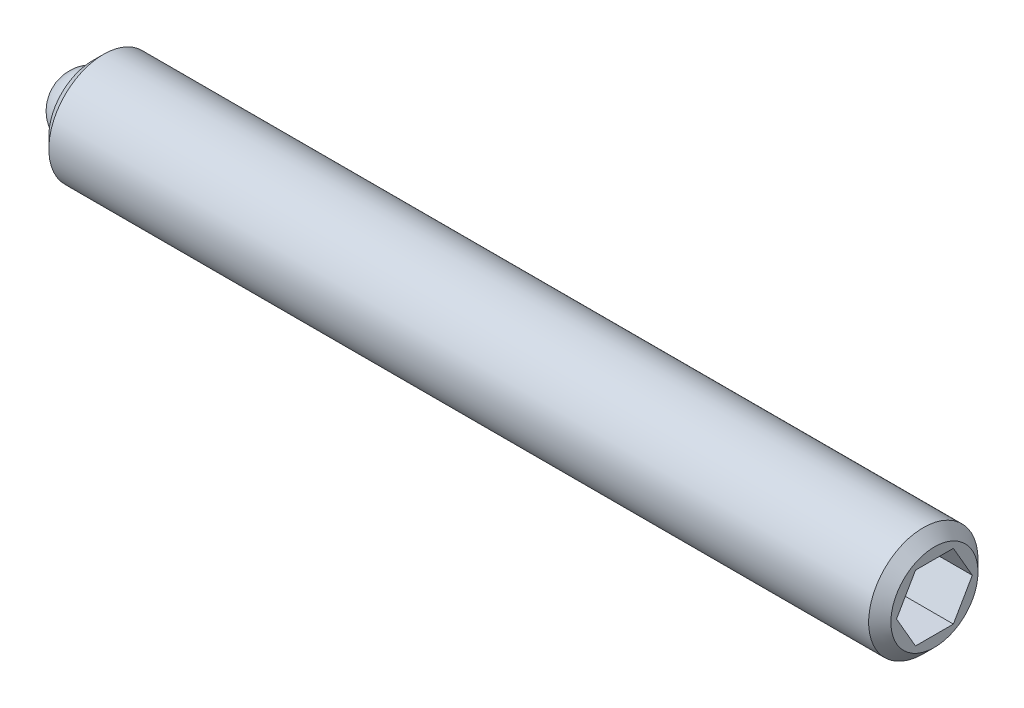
from build123d import *

# Parameters (mm, degrees)
SKETCH2_R           = 1.25
BOSS_EXTRUDE1_DEPTH = 19.25
CHAMFER1_SIZE       = 0.254
CHAMFER2_SIZE       = 0.254
CUT_EXTRUDE2_DEPTH  = 2
SKETCH3_R           = 0.75
CUT_EXTRUDE3_DEPTH  = 0.8


with BuildPart() as part:
    # Sketch2 → Boss-Extrude1 (new body)
    with BuildSketch(Plane(origin=(0, 0, 0), x_dir=(0, 0, -1), z_dir=(1, 0, 0))):
        Circle(SKETCH2_R)
    extrude(amount=BOSS_EXTRUDE1_DEPTH)

    # Chamfer1
    chamfer1_edges = [part.edges().sort_by_distance(p)[0] for p in [
        (0, 0, 1.25),
    ]]
    chamfer(chamfer1_edges, length=CHAMFER1_SIZE)

    # Chamfer2
    chamfer2_edges = [part.edges().sort_by_distance(p)[0] for p in [
        (19.25, 0, 1.25),
    ]]
    chamfer(chamfer2_edges, length=CHAMFER2_SIZE)

    # Sketch4 → Cut-Extrude2 (cut)
    with BuildSketch(Plane(origin=(19.25, 0, 0), x_dir=(0, 0, -1), z_dir=(1, 0, 0))):
        Polygon((0.866025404, 0), (0.433012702, 0.75), (-0.433012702, 0.75), (-0.866025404, 0), (-0.433012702, -0.75), (0.433012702, -0.75), align=None)
    extrude(amount=-CUT_EXTRUDE2_DEPTH, mode=Mode.SUBTRACT)

    # Sketch3 → Cut-Extrude3 (cut)
    with BuildSketch(Plane.ZY):
        Circle(SKETCH3_R)
    extrude(amount=-CUT_EXTRUDE3_DEPTH, mode=Mode.SUBTRACT)


with BuildPart() as body_2:
    # Sketch5 → Revolve1 (revolve)
    with BuildSketch(Plane.ZY):
        with BuildLine():
            Line((0, 0), (0, -0.75))
            ThreePointArc((0, -0.75), (-0.75, 0), (0, 0.75))
            Line((0, 0.75), (0, 0))
        make_face()
    revolve(axis=Axis((0, 0, 0), (0, 1, 0)))


solid = Compound([part.part, body_2.part])
